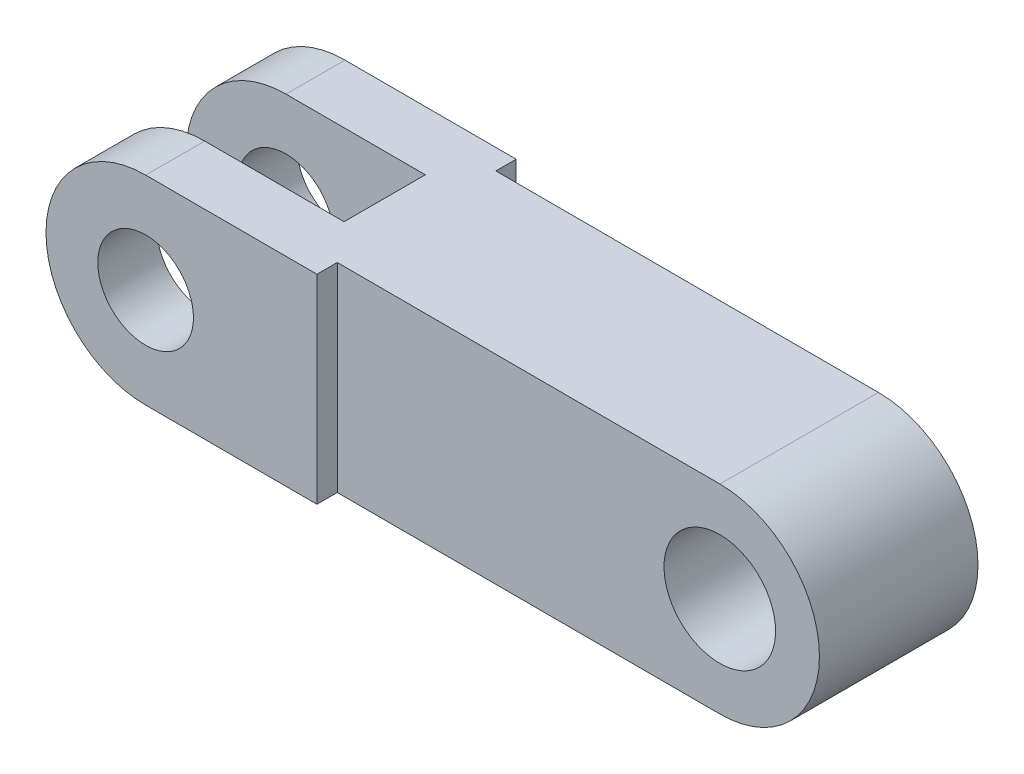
ISO-10303-21;
HEADER;
FILE_DESCRIPTION(('STEP AP214'),'2;1');
FILE_NAME('part.step','',(''),(''),'','','');
FILE_SCHEMA(('AUTOMOTIVE_DESIGN { 1 0 10303 214 1 1 1 1 }'));
ENDSEC;
DATA;
#1=APPLICATION_CONTEXT('core data for automotive mechanical design processes');
#2=APPLICATION_PROTOCOL_DEFINITION('international standard','automotive_design',2000,#1);
#3=PRODUCT_CONTEXT('',#1,'mechanical');
#4=PRODUCT('Part','Part','',(#3));
#5=PRODUCT_RELATED_PRODUCT_CATEGORY('part','',(#4));
#6=PRODUCT_DEFINITION_FORMATION('','',#4);
#7=PRODUCT_DEFINITION_CONTEXT('part definition',#1,'design');
#8=PRODUCT_DEFINITION('design','',#6,#7);
#9=PRODUCT_DEFINITION_SHAPE('','',#8);
#10=(LENGTH_UNIT() NAMED_UNIT(*) SI_UNIT(.MILLI.,.METRE.));
#11=(NAMED_UNIT(*) PLANE_ANGLE_UNIT() SI_UNIT($,.RADIAN.));
#12=(NAMED_UNIT(*) SI_UNIT($,.STERADIAN.) SOLID_ANGLE_UNIT());
#13=UNCERTAINTY_MEASURE_WITH_UNIT(LENGTH_MEASURE(1.E-05),#10,'distance_accuracy_value','');
#14=(GEOMETRIC_REPRESENTATION_CONTEXT(3) GLOBAL_UNCERTAINTY_ASSIGNED_CONTEXT((#13)) GLOBAL_UNIT_ASSIGNED_CONTEXT((#10,
#11,#12)) REPRESENTATION_CONTEXT('',''));
#15=CARTESIAN_POINT('',(0.,0.,0.));
#16=DIRECTION('',(0.,0.,1.));
#17=DIRECTION('',(1.,0.,0.));
#18=AXIS2_PLACEMENT_3D('',#15,#16,#17);
#19=CARTESIAN_POINT('',(-75.,0.,-17.6));
#20=DIRECTION('',(0.,0.,-1.));
#21=DIRECTION('',(-1.,0.,0.));
#22=AXIS2_PLACEMENT_3D('',#19,#20,#21);
#23=CYLINDRICAL_SURFACE('',#22,5.99999999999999);
#24=CARTESIAN_POINT('',(-75.,0.,-17.6));
#25=DIRECTION('',(0.,0.,-1.));
#26=DIRECTION('',(-1.,0.,0.));
#27=AXIS2_PLACEMENT_3D('',#24,#25,#26);
#28=CIRCLE('',#27,5.99999999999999);
#29=CARTESIAN_POINT('',(-81.,0.,-17.6));
#30=VERTEX_POINT('',#29);
#31=EDGE_CURVE('E16',#30,#30,#28,.F.);
#32=ORIENTED_EDGE('',*,*,#31,.T.);
#33=EDGE_LOOP('',(#32));
#34=FACE_BOUND('',#33,.T.);
#35=CARTESIAN_POINT('',(-75.,0.,-25.));
#36=DIRECTION('',(0.,0.,-1.));
#37=DIRECTION('',(-1.,0.,0.));
#38=AXIS2_PLACEMENT_3D('',#35,#36,#37);
#39=CIRCLE('',#38,5.99999999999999);
#40=CARTESIAN_POINT('',(-81.,0.,-25.));
#41=VERTEX_POINT('',#40);
#42=EDGE_CURVE('E207',#41,#41,#39,.F.);
#43=ORIENTED_EDGE('',*,*,#42,.F.);
#44=EDGE_LOOP('',(#43));
#45=FACE_BOUND('',#44,.T.);
#46=ADVANCED_FACE('F12',(#34,#45),#23,.F.);
#47=CARTESIAN_POINT('',(-5.5,-0.094581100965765,-2.55));
#48=DIRECTION('',(0.,0.,-1.));
#49=DIRECTION('',(0.,1.,0.));
#50=AXIS2_PLACEMENT_3D('',#47,#48,#49);
#51=CYLINDRICAL_SURFACE('',#50,7.);
#52=CARTESIAN_POINT('',(-5.5,-0.0945811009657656,-22.45));
#53=DIRECTION('',(0.,0.,-1.));
#54=DIRECTION('',(0.,1.,0.));
#55=AXIS2_PLACEMENT_3D('',#52,#53,#54);
#56=CIRCLE('',#55,7.);
#57=CARTESIAN_POINT('',(-5.5,6.90541889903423,-22.45));
#58=VERTEX_POINT('',#57);
#59=EDGE_CURVE('E203',#58,#58,#56,.T.);
#60=ORIENTED_EDGE('',*,*,#59,.T.);
#61=EDGE_LOOP('',(#60));
#62=FACE_BOUND('',#61,.T.);
#63=CARTESIAN_POINT('',(-5.5,-0.094581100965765,-2.55));
#64=DIRECTION('',(0.,0.,-1.));
#65=DIRECTION('',(0.,1.,0.));
#66=AXIS2_PLACEMENT_3D('',#63,#64,#65);
#67=CIRCLE('',#66,7.);
#68=CARTESIAN_POINT('',(-5.5,6.90541889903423,-2.55));
#69=VERTEX_POINT('',#68);
#70=EDGE_CURVE('E145',#69,#69,#67,.F.);
#71=ORIENTED_EDGE('',*,*,#70,.T.);
#72=EDGE_LOOP('',(#71));
#73=FACE_BOUND('',#72,.T.);
#74=ADVANCED_FACE('F277',(#62,#73),#51,.F.);
#75=CARTESIAN_POINT('',(-57.5,12.47619618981,-17.6));
#76=DIRECTION('',(1.,0.,0.));
#77=DIRECTION('',(0.,0.,1.));
#78=AXIS2_PLACEMENT_3D('',#75,#76,#77);
#79=PLANE('',#78);
#80=DIRECTION('',(0.,1.,0.));
#81=VECTOR('',#80,1.);
#82=CARTESIAN_POINT('',(-57.5,2.47617303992,-7.4));
#83=LINE('',#82,#81);
#84=CARTESIAN_POINT('',(-57.4999999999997,-12.5238269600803,-7.39999999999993));
#85=VERTEX_POINT('',#84);
#86=CARTESIAN_POINT('',(-57.5000000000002,12.4761961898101,-7.39999999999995));
#87=VERTEX_POINT('',#86);
#88=EDGE_CURVE('E95',#85,#87,#83,.T.);
#89=ORIENTED_EDGE('',*,*,#88,.T.);
#90=DIRECTION('',(0.,0.,1.));
#91=VECTOR('',#90,1.);
#92=CARTESIAN_POINT('',(-57.5000000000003,12.47619618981,-34.750032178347));
#93=LINE('',#92,#91);
#94=CARTESIAN_POINT('',(-57.5000000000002,12.4761961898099,-17.5999999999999));
#95=VERTEX_POINT('',#94);
#96=EDGE_CURVE('E152',#95,#87,#93,.T.);
#97=ORIENTED_EDGE('',*,*,#96,.F.);
#98=DIRECTION('',(0.,-1.,0.));
#99=VECTOR('',#98,1.);
#100=CARTESIAN_POINT('',(-57.5,-2.35,-17.6));
#101=LINE('',#100,#99);
#102=CARTESIAN_POINT('',(-57.4999999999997,-12.5238269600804,-17.5999999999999));
#103=VERTEX_POINT('',#102);
#104=EDGE_CURVE('E88',#95,#103,#101,.T.);
#105=ORIENTED_EDGE('',*,*,#104,.T.);
#106=DIRECTION('',(0.,0.,-1.));
#107=VECTOR('',#106,1.);
#108=CARTESIAN_POINT('',(-57.4999999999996,-12.5238269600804,-34.750032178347));
#109=LINE('',#108,#107);
#110=EDGE_CURVE('E126',#85,#103,#109,.T.);
#111=ORIENTED_EDGE('',*,*,#110,.F.);
#112=EDGE_LOOP('',(#89,#97,#105,#111));
#113=FACE_BOUND('',#112,.T.);
#114=ADVANCED_FACE('F275',(#113),#79,.F.);
#115=CARTESIAN_POINT('',(-87.8,12.8,-17.6));
#116=DIRECTION('',(0.,0.,-1.));
#117=DIRECTION('',(1.,0.,0.));
#118=AXIS2_PLACEMENT_3D('',#115,#116,#117);
#119=PLANE('',#118);
#120=ORIENTED_EDGE('',*,*,#31,.F.);
#121=EDGE_LOOP('',(#120));
#122=FACE_BOUND('',#121,.T.);
#123=CARTESIAN_POINT('',(-75.,0.,-17.6));
#124=DIRECTION('',(0.,0.,1.));
#125=DIRECTION('',(1.,0.,0.));
#126=AXIS2_PLACEMENT_3D('',#123,#124,#125);
#127=CIRCLE('',#126,12.5000000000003);
#128=CARTESIAN_POINT('',(-74.9829890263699,12.499988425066,-17.5999999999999));
#129=VERTEX_POINT('',#128);
#130=CARTESIAN_POINT('',(-75.0170109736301,-12.499988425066,-17.5999999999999));
#131=VERTEX_POINT('',#130);
#132=EDGE_CURVE('E82',#129,#131,#127,.T.);
#133=ORIENTED_EDGE('',*,*,#132,.T.);
#134=DIRECTION('',(-0.999999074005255,0.00136087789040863,0.));
#135=VECTOR('',#134,1.);
#136=CARTESIAN_POINT('',(-40.2670109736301,-12.5472789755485,-17.5999999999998));
#137=LINE('',#136,#135);
#138=EDGE_CURVE('E111',#103,#131,#137,.T.);
#139=ORIENTED_EDGE('',*,*,#138,.F.);
#140=ORIENTED_EDGE('',*,*,#104,.F.);
#141=DIRECTION('',(0.999999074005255,-0.00136087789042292,0.));
#142=VECTOR('',#141,1.);
#143=CARTESIAN_POINT('',(-40.2329890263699,12.452697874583,-17.5999999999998));
#144=LINE('',#143,#142);
#145=EDGE_CURVE('E114',#129,#95,#144,.T.);
#146=ORIENTED_EDGE('',*,*,#145,.F.);
#147=EDGE_LOOP('',(#133,#139,#140,#146));
#148=FACE_BOUND('',#147,.T.);
#149=ADVANCED_FACE('F109',(#122,#148),#119,.F.);
#150=CARTESIAN_POINT('',(-75.,0.,-25.));
#151=DIRECTION('',(0.,0.,1.));
#152=DIRECTION('',(1.,0.,0.));
#153=AXIS2_PLACEMENT_3D('',#150,#151,#152);
#154=CYLINDRICAL_SURFACE('',#153,12.5000000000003);
#155=ORIENTED_EDGE('',*,*,#132,.F.);
#156=DIRECTION('',(0.,0.,1.));
#157=VECTOR('',#156,1.);
#158=CARTESIAN_POINT('',(-74.98298902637,12.499988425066,-34.750032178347));
#159=LINE('',#158,#157);
#160=CARTESIAN_POINT('',(-74.9829890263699,12.499988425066,-24.9999999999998));
#161=VERTEX_POINT('',#160);
#162=EDGE_CURVE('E160',#161,#129,#159,.T.);
#163=ORIENTED_EDGE('',*,*,#162,.F.);
#164=CARTESIAN_POINT('',(-75.,0.,-25.));
#165=DIRECTION('',(0.,0.,1.));
#166=DIRECTION('',(1.,0.,0.));
#167=AXIS2_PLACEMENT_3D('',#164,#165,#166);
#168=CIRCLE('',#167,12.5000000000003);
#169=CARTESIAN_POINT('',(-75.0170109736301,-12.499988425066,-24.9999999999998));
#170=VERTEX_POINT('',#169);
#171=EDGE_CURVE('E116',#170,#161,#168,.F.);
#172=ORIENTED_EDGE('',*,*,#171,.F.);
#173=DIRECTION('',(0.,0.,-1.));
#174=VECTOR('',#173,1.);
#175=CARTESIAN_POINT('',(-75.01701097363,-12.499988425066,-34.750032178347));
#176=LINE('',#175,#174);
#177=EDGE_CURVE('E118',#131,#170,#176,.T.);
#178=ORIENTED_EDGE('',*,*,#177,.F.);
#179=EDGE_LOOP('',(#155,#163,#172,#178));
#180=FACE_BOUND('',#179,.T.);
#181=ADVANCED_FACE('F119',(#180),#154,.T.);
#182=CARTESIAN_POINT('',(-87.84,12.84,-25.));
#183=DIRECTION('',(0.,0.,-1.));
#184=DIRECTION('',(1.,0.,0.));
#185=AXIS2_PLACEMENT_3D('',#182,#183,#184);
#186=PLANE('',#185);
#187=ORIENTED_EDGE('',*,*,#42,.T.);
#188=EDGE_LOOP('',(#187));
#189=FACE_BOUND('',#188,.T.);
#190=ORIENTED_EDGE('',*,*,#171,.T.);
#191=DIRECTION('',(-0.999999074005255,0.00136087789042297,0.));
#192=VECTOR('',#191,1.);
#193=CARTESIAN_POINT('',(-40.2329890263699,12.452697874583,-24.9999999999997));
#194=LINE('',#193,#192);
#195=CARTESIAN_POINT('',(-53.5000000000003,12.4707526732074,-24.9999999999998));
#196=VERTEX_POINT('',#195);
#197=EDGE_CURVE('E164',#196,#161,#194,.T.);
#198=ORIENTED_EDGE('',*,*,#197,.F.);
#199=DIRECTION('',(0.,-1.,0.));
#200=VECTOR('',#199,1.);
#201=CARTESIAN_POINT('',(-53.5,-0.0292589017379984,-25.));
#202=LINE('',#201,#200);
#203=CARTESIAN_POINT('',(-53.4999999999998,-12.5292704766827,-24.9999999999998));
#204=VERTEX_POINT('',#203);
#205=EDGE_CURVE('E210',#196,#204,#202,.T.);
#206=ORIENTED_EDGE('',*,*,#205,.T.);
#207=DIRECTION('',(0.999999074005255,-0.0013608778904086,0.));
#208=VECTOR('',#207,1.);
#209=CARTESIAN_POINT('',(-40.2670109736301,-12.5472789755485,-24.9999999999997));
#210=LINE('',#209,#208);
#211=EDGE_CURVE('E122',#170,#204,#210,.T.);
#212=ORIENTED_EDGE('',*,*,#211,.F.);
#213=EDGE_LOOP('',(#190,#198,#206,#212));
#214=FACE_BOUND('',#213,.T.);
#215=ADVANCED_FACE('F213',(#189,#214),#186,.T.);
#216=CARTESIAN_POINT('',(-53.5,-12.529270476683,-25.));
#217=DIRECTION('',(-1.,0.,0.));
#218=DIRECTION('',(0.,0.,1.));
#219=AXIS2_PLACEMENT_3D('',#216,#217,#218);
#220=PLANE('',#219);
#221=ORIENTED_EDGE('',*,*,#205,.F.);
#222=DIRECTION('',(0.,0.,-1.));
#223=VECTOR('',#222,1.);
#224=CARTESIAN_POINT('',(-53.5000000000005,12.4707526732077,-34.750032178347));
#225=LINE('',#224,#223);
#226=CARTESIAN_POINT('',(-53.5000000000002,12.4707526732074,-22.4499999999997));
#227=VERTEX_POINT('',#226);
#228=EDGE_CURVE('E167',#227,#196,#225,.T.);
#229=ORIENTED_EDGE('',*,*,#228,.F.);
#230=DIRECTION('',(0.,-1.,0.));
#231=VECTOR('',#230,1.);
#232=CARTESIAN_POINT('',(-53.5,-17.779247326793,-22.45));
#233=LINE('',#232,#231);
#234=CARTESIAN_POINT('',(-53.4999999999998,-12.5292704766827,-22.4499999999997));
#235=VERTEX_POINT('',#234);
#236=EDGE_CURVE('E206',#227,#235,#233,.T.);
#237=ORIENTED_EDGE('',*,*,#236,.T.);
#238=DIRECTION('',(0.,0.,1.));
#239=VECTOR('',#238,1.);
#240=CARTESIAN_POINT('',(-53.4999999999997,-12.5292704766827,-34.750032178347));
#241=LINE('',#240,#239);
#242=EDGE_CURVE('E223',#204,#235,#241,.T.);
#243=ORIENTED_EDGE('',*,*,#242,.F.);
#244=EDGE_LOOP('',(#221,#229,#237,#243));
#245=FACE_BOUND('',#244,.T.);
#246=ADVANCED_FACE('F219',(#245),#220,.F.);
#247=CARTESIAN_POINT('',(7.605,12.470752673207,-22.45));
#248=DIRECTION('',(0.,0.,1.));
#249=DIRECTION('',(-1.,0.,0.));
#250=AXIS2_PLACEMENT_3D('',#247,#248,#249);
#251=PLANE('',#250);
#252=ORIENTED_EDGE('',*,*,#59,.F.);
#253=EDGE_LOOP('',(#252));
#254=FACE_BOUND('',#253,.T.);
#255=CARTESIAN_POINT('',(-5.5,-0.094581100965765,-22.45));
#256=DIRECTION('',(0.,0.,1.));
#257=DIRECTION('',(0.,-1.,0.));
#258=AXIS2_PLACEMENT_3D('',#255,#256,#257);
#259=CIRCLE('',#258,12.5000000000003);
#260=CARTESIAN_POINT('',(-5.48298902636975,12.4054073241,-22.4499999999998));
#261=VERTEX_POINT('',#260);
#262=CARTESIAN_POINT('',(-5.51701097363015,-12.594569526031,-22.4499999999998));
#263=VERTEX_POINT('',#262);
#264=EDGE_CURVE('E201',#261,#263,#259,.F.);
#265=ORIENTED_EDGE('',*,*,#264,.T.);
#266=DIRECTION('',(0.999999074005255,-0.0013608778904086,0.));
#267=VECTOR('',#266,1.);
#268=CARTESIAN_POINT('',(-40.2670109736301,-12.5472789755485,-22.4499999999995));
#269=LINE('',#268,#267);
#270=EDGE_CURVE('E233',#235,#263,#269,.T.);
#271=ORIENTED_EDGE('',*,*,#270,.F.);
#272=ORIENTED_EDGE('',*,*,#236,.F.);
#273=DIRECTION('',(-0.999999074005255,0.00136087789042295,0.));
#274=VECTOR('',#273,1.);
#275=CARTESIAN_POINT('',(-40.2329890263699,12.452697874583,-22.4499999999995));
#276=LINE('',#275,#274);
#277=EDGE_CURVE('E172',#261,#227,#276,.T.);
#278=ORIENTED_EDGE('',*,*,#277,.F.);
#279=EDGE_LOOP('',(#265,#271,#272,#278));
#280=FACE_BOUND('',#279,.T.);
#281=ADVANCED_FACE('F309',(#254,#280),#251,.F.);
#282=CARTESIAN_POINT('',(-5.5,-0.094581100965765,-22.45));
#283=DIRECTION('',(0.,0.,1.));
#284=DIRECTION('',(0.,-1.,0.));
#285=AXIS2_PLACEMENT_3D('',#282,#283,#284);
#286=CYLINDRICAL_SURFACE('',#285,12.5000000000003);
#287=ORIENTED_EDGE('',*,*,#264,.F.);
#288=DIRECTION('',(0.,0.,-1.));
#289=VECTOR('',#288,1.);
#290=CARTESIAN_POINT('',(-5.4829890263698,12.4054073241,-34.750032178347));
#291=LINE('',#290,#289);
#292=CARTESIAN_POINT('',(-5.48298902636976,12.4054073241,-2.55));
#293=VERTEX_POINT('',#292);
#294=EDGE_CURVE('E177',#293,#261,#291,.T.);
#295=ORIENTED_EDGE('',*,*,#294,.F.);
#296=CARTESIAN_POINT('',(-5.5,-0.0945811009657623,-2.55));
#297=DIRECTION('',(0.,0.,1.));
#298=DIRECTION('',(0.,-1.,0.));
#299=AXIS2_PLACEMENT_3D('',#296,#297,#298);
#300=CIRCLE('',#299,12.5000000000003);
#301=CARTESIAN_POINT('',(-5.51701097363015,-12.594569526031,-2.55000000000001));
#302=VERTEX_POINT('',#301);
#303=EDGE_CURVE('E199',#293,#302,#300,.F.);
#304=ORIENTED_EDGE('',*,*,#303,.T.);
#305=DIRECTION('',(0.,0.,1.));
#306=VECTOR('',#305,1.);
#307=CARTESIAN_POINT('',(-5.5170109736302,-12.594569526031,-34.750032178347));
#308=LINE('',#307,#306);
#309=EDGE_CURVE('E235',#263,#302,#308,.T.);
#310=ORIENTED_EDGE('',*,*,#309,.F.);
#311=EDGE_LOOP('',(#287,#295,#304,#310));
#312=FACE_BOUND('',#311,.T.);
#313=ADVANCED_FACE('F306',(#312),#286,.T.);
#314=CARTESIAN_POINT('',(7.605,-13.199581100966,-2.55));
#315=DIRECTION('',(0.,0.,-1.));
#316=DIRECTION('',(-1.,0.,0.));
#317=AXIS2_PLACEMENT_3D('',#314,#315,#316);
#318=PLANE('',#317);
#319=ORIENTED_EDGE('',*,*,#70,.F.);
#320=EDGE_LOOP('',(#319));
#321=FACE_BOUND('',#320,.T.);
#322=DIRECTION('',(-0.999999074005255,0.0013608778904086,0.));
#323=VECTOR('',#322,1.);
#324=CARTESIAN_POINT('',(-40.2670109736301,-12.5472789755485,-2.55000000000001));
#325=LINE('',#324,#323);
#326=CARTESIAN_POINT('',(-53.5,-12.5292704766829,-2.55000000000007));
#327=VERTEX_POINT('',#326);
#328=EDGE_CURVE('E244',#302,#327,#325,.T.);
#329=ORIENTED_EDGE('',*,*,#328,.F.);
#330=ORIENTED_EDGE('',*,*,#303,.F.);
#331=DIRECTION('',(0.999999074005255,-0.00136087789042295,0.));
#332=VECTOR('',#331,1.);
#333=CARTESIAN_POINT('',(-40.2329890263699,12.452697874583,-2.55000000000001));
#334=LINE('',#333,#332);
#335=CARTESIAN_POINT('',(-53.5,12.4707526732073,-2.55000000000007));
#336=VERTEX_POINT('',#335);
#337=EDGE_CURVE('E144',#336,#293,#334,.T.);
#338=ORIENTED_EDGE('',*,*,#337,.F.);
#339=DIRECTION('',(0.,-1.,0.));
#340=VECTOR('',#339,1.);
#341=CARTESIAN_POINT('',(-53.5,-0.0292589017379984,-2.55000000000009));
#342=LINE('',#341,#340);
#343=EDGE_CURVE('E194',#336,#327,#342,.T.);
#344=ORIENTED_EDGE('',*,*,#343,.T.);
#345=EDGE_LOOP('',(#329,#330,#338,#344));
#346=FACE_BOUND('',#345,.T.);
#347=ADVANCED_FACE('F303',(#321,#346),#318,.F.);
#348=CARTESIAN_POINT('',(-87.8,-12.52382696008,-7.4));
#349=DIRECTION('',(0.,0.,1.));
#350=DIRECTION('',(1.,0.,0.));
#351=AXIS2_PLACEMENT_3D('',#348,#349,#350);
#352=PLANE('',#351);
#353=CARTESIAN_POINT('',(-75.,0.,-7.4));
#354=DIRECTION('',(0.,0.,-1.));
#355=DIRECTION('',(-1.,0.,0.));
#356=AXIS2_PLACEMENT_3D('',#353,#354,#355);
#357=CIRCLE('',#356,5.99999999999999);
#358=CARTESIAN_POINT('',(-81.,0.,-7.4));
#359=VERTEX_POINT('',#358);
#360=EDGE_CURVE('E191',#359,#359,#357,.T.);
#361=ORIENTED_EDGE('',*,*,#360,.F.);
#362=EDGE_LOOP('',(#361));
#363=FACE_BOUND('',#362,.T.);
#364=DIRECTION('',(0.999999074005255,-0.0013608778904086,0.));
#365=VECTOR('',#364,1.);
#366=CARTESIAN_POINT('',(-40.2670109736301,-12.5472789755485,-7.39999999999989));
#367=LINE('',#366,#365);
#368=CARTESIAN_POINT('',(-75.0170109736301,-12.499988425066,-7.39999999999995));
#369=VERTEX_POINT('',#368);
#370=EDGE_CURVE('E128',#369,#85,#367,.T.);
#371=ORIENTED_EDGE('',*,*,#370,.F.);
#372=CARTESIAN_POINT('',(-75.,0.,-7.4));
#373=DIRECTION('',(0.,0.,1.));
#374=DIRECTION('',(0.,-1.,0.));
#375=AXIS2_PLACEMENT_3D('',#372,#373,#374);
#376=CIRCLE('',#375,12.5000000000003);
#377=CARTESIAN_POINT('',(-74.9829890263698,12.499988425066,-7.39999999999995));
#378=VERTEX_POINT('',#377);
#379=EDGE_CURVE('E151',#369,#378,#376,.F.);
#380=ORIENTED_EDGE('',*,*,#379,.T.);
#381=DIRECTION('',(-0.999999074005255,0.00136087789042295,0.));
#382=VECTOR('',#381,1.);
#383=CARTESIAN_POINT('',(-40.2329890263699,12.452697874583,-7.39999999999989));
#384=LINE('',#383,#382);
#385=EDGE_CURVE('E148',#87,#378,#384,.T.);
#386=ORIENTED_EDGE('',*,*,#385,.F.);
#387=ORIENTED_EDGE('',*,*,#88,.F.);
#388=EDGE_LOOP('',(#371,#380,#386,#387));
#389=FACE_BOUND('',#388,.T.);
#390=ADVANCED_FACE('F274',(#363,#389),#352,.F.);
#391=CARTESIAN_POINT('',(-5.4829890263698,12.4054073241,0.));
#392=DIRECTION('',(0.00136087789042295,0.999999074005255,0.));
#393=DIRECTION('',(0.,0.,-1.));
#394=AXIS2_PLACEMENT_3D('',#391,#392,#393);
#395=PLANE('',#394);
#396=ORIENTED_EDGE('',*,*,#385,.T.);
#397=DIRECTION('',(0.,0.,1.));
#398=VECTOR('',#397,1.);
#399=CARTESIAN_POINT('',(-74.9829890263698,12.499988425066,-3.7));
#400=LINE('',#399,#398);
#401=CARTESIAN_POINT('',(-74.9829890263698,12.4999884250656,0.));
#402=VERTEX_POINT('',#401);
#403=EDGE_CURVE('E196',#378,#402,#400,.T.);
#404=ORIENTED_EDGE('',*,*,#403,.T.);
#405=DIRECTION('',(-0.999999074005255,0.00136087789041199,0.));
#406=VECTOR('',#405,1.);
#407=CARTESIAN_POINT('',(-53.5,12.4707526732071,0.));
#408=LINE('',#407,#406);
#409=CARTESIAN_POINT('',(-53.5,12.4707526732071,0.));
#410=VERTEX_POINT('',#409);
#411=EDGE_CURVE('E188',#410,#402,#408,.T.);
#412=ORIENTED_EDGE('',*,*,#411,.F.);
#413=DIRECTION('',(0.,0.,-1.));
#414=VECTOR('',#413,1.);
#415=CARTESIAN_POINT('',(-53.5,12.470752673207,-12.500011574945));
#416=LINE('',#415,#414);
#417=EDGE_CURVE('E252',#410,#336,#416,.T.);
#418=ORIENTED_EDGE('',*,*,#417,.T.);
#419=ORIENTED_EDGE('',*,*,#337,.T.);
#420=ORIENTED_EDGE('',*,*,#294,.T.);
#421=ORIENTED_EDGE('',*,*,#277,.T.);
#422=ORIENTED_EDGE('',*,*,#228,.T.);
#423=ORIENTED_EDGE('',*,*,#197,.T.);
#424=ORIENTED_EDGE('',*,*,#162,.T.);
#425=ORIENTED_EDGE('',*,*,#145,.T.);
#426=ORIENTED_EDGE('',*,*,#96,.T.);
#427=EDGE_LOOP('',(#396,#404,#412,#418,#419,#420,#421,#422,#423,#424,#425,#426));
#428=FACE_BOUND('',#427,.T.);
#429=ADVANCED_FACE('F215',(#428),#395,.T.);
#430=CARTESIAN_POINT('',(-75.,0.,-7.4));
#431=DIRECTION('',(0.,0.,1.));
#432=DIRECTION('',(0.,-1.,0.));
#433=AXIS2_PLACEMENT_3D('',#430,#431,#432);
#434=CYLINDRICAL_SURFACE('',#433,12.5000000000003);
#435=ORIENTED_EDGE('',*,*,#403,.F.);
#436=ORIENTED_EDGE('',*,*,#379,.F.);
#437=DIRECTION('',(0.,0.,-1.));
#438=VECTOR('',#437,1.);
#439=CARTESIAN_POINT('',(-75.01701097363,-12.499988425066,-34.750032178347));
#440=LINE('',#439,#438);
#441=CARTESIAN_POINT('',(-75.0170109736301,-12.499988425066,0.));
#442=VERTEX_POINT('',#441);
#443=EDGE_CURVE('E140',#442,#369,#440,.T.);
#444=ORIENTED_EDGE('',*,*,#443,.F.);
#445=CARTESIAN_POINT('',(-75.,0.,0.));
#446=DIRECTION('',(0.,0.,1.));
#447=DIRECTION('',(0.,-1.,0.));
#448=AXIS2_PLACEMENT_3D('',#445,#446,#447);
#449=CIRCLE('',#448,12.5000000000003);
#450=EDGE_CURVE('E185',#402,#442,#449,.T.);
#451=ORIENTED_EDGE('',*,*,#450,.F.);
#452=EDGE_LOOP('',(#435,#436,#444,#451));
#453=FACE_BOUND('',#452,.T.);
#454=ADVANCED_FACE('F272',(#453),#434,.T.);
#455=CARTESIAN_POINT('',(-75.01701097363,-12.499988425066,0.));
#456=DIRECTION('',(-0.0013608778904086,-0.999999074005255,0.));
#457=DIRECTION('',(0.,0.,-1.));
#458=AXIS2_PLACEMENT_3D('',#455,#456,#457);
#459=PLANE('',#458);
#460=ORIENTED_EDGE('',*,*,#328,.T.);
#461=DIRECTION('',(0.,0.,1.));
#462=VECTOR('',#461,1.);
#463=CARTESIAN_POINT('',(-53.5,-12.529270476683,-12.500011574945));
#464=LINE('',#463,#462);
#465=CARTESIAN_POINT('',(-53.5,-12.529270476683,0.));
#466=VERTEX_POINT('',#465);
#467=EDGE_CURVE('E31',#327,#466,#464,.T.);
#468=ORIENTED_EDGE('',*,*,#467,.T.);
#469=DIRECTION('',(0.999999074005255,-0.00136087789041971,0.));
#470=VECTOR('',#469,1.);
#471=CARTESIAN_POINT('',(-75.0170109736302,-12.499988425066,0.));
#472=LINE('',#471,#470);
#473=EDGE_CURVE('E182',#442,#466,#472,.T.);
#474=ORIENTED_EDGE('',*,*,#473,.F.);
#475=ORIENTED_EDGE('',*,*,#443,.T.);
#476=ORIENTED_EDGE('',*,*,#370,.T.);
#477=ORIENTED_EDGE('',*,*,#110,.T.);
#478=ORIENTED_EDGE('',*,*,#138,.T.);
#479=ORIENTED_EDGE('',*,*,#177,.T.);
#480=ORIENTED_EDGE('',*,*,#211,.T.);
#481=ORIENTED_EDGE('',*,*,#242,.T.);
#482=ORIENTED_EDGE('',*,*,#270,.T.);
#483=ORIENTED_EDGE('',*,*,#309,.T.);
#484=EDGE_LOOP('',(#460,#468,#474,#475,#476,#477,#478,#479,#480,#481,#482,#483));
#485=FACE_BOUND('',#484,.T.);
#486=ADVANCED_FACE('F124',(#485),#459,.T.);
#487=CARTESIAN_POINT('',(-53.5,12.470752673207,0.));
#488=DIRECTION('',(-1.,0.,0.));
#489=DIRECTION('',(0.,0.,-1.));
#490=AXIS2_PLACEMENT_3D('',#487,#488,#489);
#491=PLANE('',#490);
#492=ORIENTED_EDGE('',*,*,#417,.F.);
#493=DIRECTION('',(0.,1.,0.));
#494=VECTOR('',#493,1.);
#495=CARTESIAN_POINT('',(-53.5,4.470729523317,0.));
#496=LINE('',#495,#494);
#497=EDGE_CURVE('E22',#466,#410,#496,.T.);
#498=ORIENTED_EDGE('',*,*,#497,.F.);
#499=ORIENTED_EDGE('',*,*,#467,.F.);
#500=ORIENTED_EDGE('',*,*,#343,.F.);
#501=EDGE_LOOP('',(#492,#498,#499,#500));
#502=FACE_BOUND('',#501,.T.);
#503=ADVANCED_FACE('F293',(#502),#491,.F.);
#504=CARTESIAN_POINT('',(-75.,0.,0.));
#505=DIRECTION('',(0.,0.,-1.));
#506=DIRECTION('',(-1.,0.,0.));
#507=AXIS2_PLACEMENT_3D('',#504,#505,#506);
#508=CYLINDRICAL_SURFACE('',#507,5.99999999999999);
#509=ORIENTED_EDGE('',*,*,#360,.T.);
#510=EDGE_LOOP('',(#509));
#511=FACE_BOUND('',#510,.T.);
#512=CARTESIAN_POINT('',(-75.,0.,0.));
#513=DIRECTION('',(0.,0.,-1.));
#514=DIRECTION('',(-1.,0.,0.));
#515=AXIS2_PLACEMENT_3D('',#512,#513,#514);
#516=CIRCLE('',#515,5.99999999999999);
#517=CARTESIAN_POINT('',(-81.,0.,0.));
#518=VERTEX_POINT('',#517);
#519=EDGE_CURVE('E9',#518,#518,#516,.T.);
#520=ORIENTED_EDGE('',*,*,#519,.F.);
#521=EDGE_LOOP('',(#520));
#522=FACE_BOUND('',#521,.T.);
#523=ADVANCED_FACE('F289',(#511,#522),#508,.F.);
#524=CARTESIAN_POINT('',(-87.84,-12.529270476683,0.));
#525=DIRECTION('',(0.,0.,1.));
#526=DIRECTION('',(1.,0.,0.));
#527=AXIS2_PLACEMENT_3D('',#524,#525,#526);
#528=PLANE('',#527);
#529=ORIENTED_EDGE('',*,*,#519,.T.);
#530=EDGE_LOOP('',(#529));
#531=FACE_BOUND('',#530,.T.);
#532=ORIENTED_EDGE('',*,*,#473,.T.);
#533=ORIENTED_EDGE('',*,*,#497,.T.);
#534=ORIENTED_EDGE('',*,*,#411,.T.);
#535=ORIENTED_EDGE('',*,*,#450,.T.);
#536=EDGE_LOOP('',(#532,#533,#534,#535));
#537=FACE_BOUND('',#536,.T.);
#538=ADVANCED_FACE('F14',(#531,#537),#528,.T.);
#539=CLOSED_SHELL('',(#46,#74,#114,#149,#181,#215,#246,#281,#313,#347,#390,#429,#454,#486,#503,
#523,#538));
#540=MANIFOLD_SOLID_BREP('B1',#539);
#541=ADVANCED_BREP_SHAPE_REPRESENTATION('',(#18,#540),#14);
#542=SHAPE_DEFINITION_REPRESENTATION(#9,#541);
ENDSEC;
END-ISO-10303-21;
